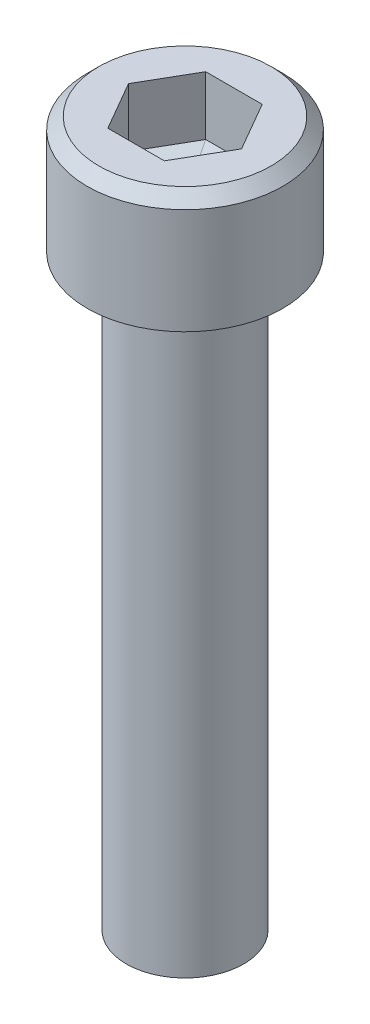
ISO-10303-21;
HEADER;
FILE_DESCRIPTION(('STEP AP214'),'2;1');
FILE_NAME('part.step','',(''),(''),'','','');
FILE_SCHEMA(('AUTOMOTIVE_DESIGN { 1 0 10303 214 1 1 1 1 }'));
ENDSEC;
DATA;
#1=APPLICATION_CONTEXT('core data for automotive mechanical design processes');
#2=APPLICATION_PROTOCOL_DEFINITION('international standard','automotive_design',2000,#1);
#3=PRODUCT_CONTEXT('',#1,'mechanical');
#4=PRODUCT('Part','Part','',(#3));
#5=PRODUCT_RELATED_PRODUCT_CATEGORY('part','',(#4));
#6=PRODUCT_DEFINITION_FORMATION('','',#4);
#7=PRODUCT_DEFINITION_CONTEXT('part definition',#1,'design');
#8=PRODUCT_DEFINITION('design','',#6,#7);
#9=PRODUCT_DEFINITION_SHAPE('','',#8);
#10=(LENGTH_UNIT() NAMED_UNIT(*) SI_UNIT(.MILLI.,.METRE.));
#11=(NAMED_UNIT(*) PLANE_ANGLE_UNIT() SI_UNIT($,.RADIAN.));
#12=(NAMED_UNIT(*) SI_UNIT($,.STERADIAN.) SOLID_ANGLE_UNIT());
#13=UNCERTAINTY_MEASURE_WITH_UNIT(LENGTH_MEASURE(1.E-05),#10,'distance_accuracy_value','');
#14=(GEOMETRIC_REPRESENTATION_CONTEXT(3) GLOBAL_UNCERTAINTY_ASSIGNED_CONTEXT((#13)) GLOBAL_UNIT_ASSIGNED_CONTEXT((#10,
#11,#12)) REPRESENTATION_CONTEXT('',''));
#15=CARTESIAN_POINT('',(0.,0.,0.));
#16=DIRECTION('',(0.,0.,1.));
#17=DIRECTION('',(1.,0.,0.));
#18=AXIS2_PLACEMENT_3D('',#15,#16,#17);
#19=CARTESIAN_POINT('',(-1.082531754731,-3.29999999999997,0.625000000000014));
#20=DIRECTION('',(-0.202106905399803,-0.972387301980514,0.116686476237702));
#21=DIRECTION('',(0.979075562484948,-0.203497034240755,0.));
#22=AXIS2_PLACEMENT_3D('',#19,#20,#21);
#23=PLANE('',#22);
#24=DIRECTION('',(0.500000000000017,0.,0.866025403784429));
#25=VECTOR('',#24,1.);
#26=CARTESIAN_POINT('',(-2.886751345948,-3.00000000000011,0.));
#27=LINE('',#26,#25);
#28=CARTESIAN_POINT('',(-2.88675134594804,-3.0000000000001,0.));
#29=VERTEX_POINT('',#28);
#30=CARTESIAN_POINT('',(-1.44337567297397,-3.00000000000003,2.49999999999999));
#31=VERTEX_POINT('',#30);
#32=EDGE_CURVE('E106',#29,#31,#27,.T.);
#33=ORIENTED_EDGE('',*,*,#32,.T.);
#34=DIRECTION('',(0.489537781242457,-0.203497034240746,-0.847904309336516));
#35=VECTOR('',#34,1.);
#36=CARTESIAN_POINT('',(-1.44337567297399,-2.99999999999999,2.5));
#37=LINE('',#36,#35);
#38=CARTESIAN_POINT('',(0.,-3.60000000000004,0.));
#39=VERTEX_POINT('',#38);
#40=EDGE_CURVE('E105',#31,#39,#37,.T.);
#41=ORIENTED_EDGE('',*,*,#40,.T.);
#42=DIRECTION('',(0.979075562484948,-0.203497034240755,0.));
#43=VECTOR('',#42,1.);
#44=CARTESIAN_POINT('',(-1.09747467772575,-3.37189417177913,0.));
#45=LINE('',#44,#43);
#46=EDGE_CURVE('E70',#39,#29,#45,.F.);
#47=ORIENTED_EDGE('',*,*,#46,.T.);
#48=EDGE_LOOP('',(#33,#41,#47));
#49=FACE_BOUND('',#48,.T.);
#50=ADVANCED_FACE('F16',(#49),#23,.F.);
#51=CARTESIAN_POINT('',(-1.082531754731,-3.29999999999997,-0.624999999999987));
#52=DIRECTION('',(-0.202106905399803,-0.972387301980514,-0.116686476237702));
#53=DIRECTION('',(0.979075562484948,-0.203497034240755,0.));
#54=AXIS2_PLACEMENT_3D('',#51,#52,#53);
#55=PLANE('',#54);
#56=DIRECTION('',(-0.500000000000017,0.,0.866025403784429));
#57=VECTOR('',#56,1.);
#58=CARTESIAN_POINT('',(-1.443375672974,-3.,-2.5));
#59=LINE('',#58,#57);
#60=CARTESIAN_POINT('',(-1.443375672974,-3.,-2.5));
#61=VERTEX_POINT('',#60);
#62=EDGE_CURVE('E78',#61,#29,#59,.T.);
#63=ORIENTED_EDGE('',*,*,#62,.T.);
#64=ORIENTED_EDGE('',*,*,#46,.F.);
#65=DIRECTION('',(-0.489537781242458,0.203497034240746,-0.847904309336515));
#66=VECTOR('',#65,1.);
#67=CARTESIAN_POINT('',(0.,-3.59999999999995,0.));
#68=LINE('',#67,#66);
#69=EDGE_CURVE('E75',#39,#61,#68,.T.);
#70=ORIENTED_EDGE('',*,*,#69,.T.);
#71=EDGE_LOOP('',(#63,#64,#70));
#72=FACE_BOUND('',#71,.T.);
#73=ADVANCED_FACE('F74',(#72),#55,.F.);
#74=CARTESIAN_POINT('',(0.,-3.29999999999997,-1.25));
#75=DIRECTION('',(0.,-0.972387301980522,-0.233372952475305));
#76=DIRECTION('',(0.,0.233372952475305,-0.972387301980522));
#77=AXIS2_PLACEMENT_3D('',#74,#75,#76);
#78=PLANE('',#77);
#79=DIRECTION('',(1.,0.,0.));
#80=VECTOR('',#79,1.);
#81=CARTESIAN_POINT('',(1.443375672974,-3.,-2.5));
#82=LINE('',#81,#80);
#83=CARTESIAN_POINT('',(1.44337567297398,-3.00000000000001,-2.49999999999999));
#84=VERTEX_POINT('',#83);
#85=EDGE_CURVE('E87',#84,#61,#82,.F.);
#86=ORIENTED_EDGE('',*,*,#85,.T.);
#87=ORIENTED_EDGE('',*,*,#69,.F.);
#88=DIRECTION('',(0.489537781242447,0.203497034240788,-0.847904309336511));
#89=VECTOR('',#88,1.);
#90=CARTESIAN_POINT('',(0.,-3.60000000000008,0.));
#91=LINE('',#90,#89);
#92=EDGE_CURVE('E84',#39,#84,#91,.T.);
#93=ORIENTED_EDGE('',*,*,#92,.T.);
#94=EDGE_LOOP('',(#86,#87,#93));
#95=FACE_BOUND('',#94,.T.);
#96=ADVANCED_FACE('F83',(#95),#78,.F.);
#97=CARTESIAN_POINT('',(1.082531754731,-3.29999999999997,-0.624999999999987));
#98=DIRECTION('',(0.202106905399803,-0.972387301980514,-0.116686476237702));
#99=DIRECTION('',(0.979075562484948,0.203497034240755,0.));
#100=AXIS2_PLACEMENT_3D('',#97,#98,#99);
#101=PLANE('',#100);
#102=DIRECTION('',(-0.500000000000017,0.,-0.866025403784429));
#103=VECTOR('',#102,1.);
#104=CARTESIAN_POINT('',(2.886751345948,-3.00000000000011,0.));
#105=LINE('',#104,#103);
#106=CARTESIAN_POINT('',(2.88675134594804,-3.0000000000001,0.));
#107=VERTEX_POINT('',#106);
#108=EDGE_CURVE('E95',#107,#84,#105,.T.);
#109=ORIENTED_EDGE('',*,*,#108,.T.);
#110=ORIENTED_EDGE('',*,*,#92,.F.);
#111=DIRECTION('',(0.979075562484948,0.203497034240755,0.));
#112=VECTOR('',#111,1.);
#113=CARTESIAN_POINT('',(1.09747467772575,-3.37189417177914,0.));
#114=LINE('',#113,#112);
#115=EDGE_CURVE('E92',#39,#107,#114,.T.);
#116=ORIENTED_EDGE('',*,*,#115,.T.);
#117=EDGE_LOOP('',(#109,#110,#116));
#118=FACE_BOUND('',#117,.T.);
#119=ADVANCED_FACE('F91',(#118),#101,.F.);
#120=CARTESIAN_POINT('',(1.082531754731,-3.29999999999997,0.625000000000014));
#121=DIRECTION('',(0.202106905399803,-0.972387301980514,0.116686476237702));
#122=DIRECTION('',(0.979075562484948,0.203497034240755,0.));
#123=AXIS2_PLACEMENT_3D('',#120,#121,#122);
#124=PLANE('',#123);
#125=DIRECTION('',(0.500000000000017,0.,-0.866025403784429));
#126=VECTOR('',#125,1.);
#127=CARTESIAN_POINT('',(1.443375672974,-3.,2.5));
#128=LINE('',#127,#126);
#129=CARTESIAN_POINT('',(1.443375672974,-3.,2.5));
#130=VERTEX_POINT('',#129);
#131=EDGE_CURVE('E102',#130,#107,#128,.T.);
#132=ORIENTED_EDGE('',*,*,#131,.T.);
#133=ORIENTED_EDGE('',*,*,#115,.F.);
#134=DIRECTION('',(0.489537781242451,0.203497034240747,0.847904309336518));
#135=VECTOR('',#134,1.);
#136=CARTESIAN_POINT('',(0.,-3.59999999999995,0.));
#137=LINE('',#136,#135);
#138=EDGE_CURVE('E100',#39,#130,#137,.T.);
#139=ORIENTED_EDGE('',*,*,#138,.T.);
#140=EDGE_LOOP('',(#132,#133,#139));
#141=FACE_BOUND('',#140,.T.);
#142=ADVANCED_FACE('F98',(#141),#124,.F.);
#143=CARTESIAN_POINT('',(0.,-3.29999999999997,1.25));
#144=DIRECTION('',(0.,-0.972387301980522,0.233372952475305));
#145=DIRECTION('',(0.,-0.233372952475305,-0.972387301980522));
#146=AXIS2_PLACEMENT_3D('',#143,#144,#145);
#147=PLANE('',#146);
#148=DIRECTION('',(1.,0.,0.));
#149=VECTOR('',#148,1.);
#150=CARTESIAN_POINT('',(-1.443375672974,-3.,2.5));
#151=LINE('',#150,#149);
#152=EDGE_CURVE('E112',#31,#130,#151,.T.);
#153=ORIENTED_EDGE('',*,*,#152,.T.);
#154=ORIENTED_EDGE('',*,*,#138,.F.);
#155=ORIENTED_EDGE('',*,*,#40,.F.);
#156=EDGE_LOOP('',(#153,#154,#155));
#157=FACE_BOUND('',#156,.T.);
#158=ADVANCED_FACE('F111',(#157),#147,.F.);
#159=CARTESIAN_POINT('',(-2.886751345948,0.,0.));
#160=DIRECTION('',(-0.866025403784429,0.,0.500000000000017));
#161=DIRECTION('',(0.500000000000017,0.,0.866025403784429));
#162=AXIS2_PLACEMENT_3D('',#159,#160,#161);
#163=PLANE('',#162);
#164=DIRECTION('',(0.,-1.,0.));
#165=VECTOR('',#164,1.);
#166=CARTESIAN_POINT('',(-1.44337567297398,0.,2.5));
#167=LINE('',#166,#165);
#168=CARTESIAN_POINT('',(-1.44337567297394,0.,2.49999999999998));
#169=VERTEX_POINT('',#168);
#170=EDGE_CURVE('E148',#169,#31,#167,.T.);
#171=ORIENTED_EDGE('',*,*,#170,.T.);
#172=ORIENTED_EDGE('',*,*,#32,.F.);
#173=DIRECTION('',(0.,1.,0.));
#174=VECTOR('',#173,1.);
#175=CARTESIAN_POINT('',(-2.88675134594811,0.,0.));
#176=LINE('',#175,#174);
#177=CARTESIAN_POINT('',(-2.88675134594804,0.,0.));
#178=VERTEX_POINT('',#177);
#179=EDGE_CURVE('E159',#29,#178,#176,.T.);
#180=ORIENTED_EDGE('',*,*,#179,.T.);
#181=DIRECTION('',(-0.499999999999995,0.,-0.866025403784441));
#182=VECTOR('',#181,1.);
#183=CARTESIAN_POINT('',(-1.44337567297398,0.,2.49999999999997));
#184=LINE('',#183,#182);
#185=EDGE_CURVE('E143',#169,#178,#184,.T.);
#186=ORIENTED_EDGE('',*,*,#185,.F.);
#187=EDGE_LOOP('',(#171,#172,#180,#186));
#188=FACE_BOUND('',#187,.T.);
#189=ADVANCED_FACE('F164',(#188),#163,.F.);
#190=CARTESIAN_POINT('',(-1.443375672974,0.,-2.5));
#191=DIRECTION('',(-0.866025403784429,0.,-0.500000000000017));
#192=DIRECTION('',(-0.500000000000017,0.,0.866025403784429));
#193=AXIS2_PLACEMENT_3D('',#190,#191,#192);
#194=PLANE('',#193);
#195=ORIENTED_EDGE('',*,*,#179,.F.);
#196=ORIENTED_EDGE('',*,*,#62,.F.);
#197=DIRECTION('',(0.,1.,0.));
#198=VECTOR('',#197,1.);
#199=CARTESIAN_POINT('',(-1.443375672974,0.,-2.5));
#200=LINE('',#199,#198);
#201=CARTESIAN_POINT('',(-1.443375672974,0.,-2.5));
#202=VERTEX_POINT('',#201);
#203=EDGE_CURVE('E156',#61,#202,#200,.T.);
#204=ORIENTED_EDGE('',*,*,#203,.T.);
#205=DIRECTION('',(0.499999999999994,0.,-0.866025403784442));
#206=VECTOR('',#205,1.);
#207=CARTESIAN_POINT('',(-2.88675134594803,0.,0.));
#208=LINE('',#207,#206);
#209=EDGE_CURVE('E140',#178,#202,#208,.T.);
#210=ORIENTED_EDGE('',*,*,#209,.F.);
#211=EDGE_LOOP('',(#195,#196,#204,#210));
#212=FACE_BOUND('',#211,.T.);
#213=ADVANCED_FACE('F167',(#212),#194,.F.);
#214=CARTESIAN_POINT('',(1.443375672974,0.,-2.5));
#215=DIRECTION('',(0.,0.,-1.));
#216=DIRECTION('',(0.,1.,0.));
#217=AXIS2_PLACEMENT_3D('',#214,#215,#216);
#218=PLANE('',#217);
#219=ORIENTED_EDGE('',*,*,#203,.F.);
#220=ORIENTED_EDGE('',*,*,#85,.F.);
#221=DIRECTION('',(0.,1.,0.));
#222=VECTOR('',#221,1.);
#223=CARTESIAN_POINT('',(1.4433756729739,0.,-2.49999999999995));
#224=LINE('',#223,#222);
#225=CARTESIAN_POINT('',(1.44337567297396,0.,-2.49999999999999));
#226=VERTEX_POINT('',#225);
#227=EDGE_CURVE('E153',#84,#226,#224,.T.);
#228=ORIENTED_EDGE('',*,*,#227,.T.);
#229=DIRECTION('',(1.,0.,0.));
#230=VECTOR('',#229,1.);
#231=CARTESIAN_POINT('',(0.,0.,-2.5));
#232=LINE('',#231,#230);
#233=EDGE_CURVE('E137',#202,#226,#232,.T.);
#234=ORIENTED_EDGE('',*,*,#233,.F.);
#235=EDGE_LOOP('',(#219,#220,#228,#234));
#236=FACE_BOUND('',#235,.T.);
#237=ADVANCED_FACE('F266',(#236),#218,.F.);
#238=CARTESIAN_POINT('',(2.886751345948,0.,0.));
#239=DIRECTION('',(0.866025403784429,0.,-0.500000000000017));
#240=DIRECTION('',(-0.500000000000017,0.,-0.866025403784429));
#241=AXIS2_PLACEMENT_3D('',#238,#239,#240);
#242=PLANE('',#241);
#243=ORIENTED_EDGE('',*,*,#227,.F.);
#244=ORIENTED_EDGE('',*,*,#108,.F.);
#245=DIRECTION('',(0.,1.,0.));
#246=VECTOR('',#245,1.);
#247=CARTESIAN_POINT('',(2.88675134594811,0.,0.));
#248=LINE('',#247,#246);
#249=CARTESIAN_POINT('',(2.88675134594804,0.,0.));
#250=VERTEX_POINT('',#249);
#251=EDGE_CURVE('E150',#107,#250,#248,.T.);
#252=ORIENTED_EDGE('',*,*,#251,.T.);
#253=DIRECTION('',(0.499999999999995,0.,0.866025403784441));
#254=VECTOR('',#253,1.);
#255=CARTESIAN_POINT('',(1.44337567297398,0.,-2.49999999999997));
#256=LINE('',#255,#254);
#257=EDGE_CURVE('E134',#226,#250,#256,.T.);
#258=ORIENTED_EDGE('',*,*,#257,.F.);
#259=EDGE_LOOP('',(#243,#244,#252,#258));
#260=FACE_BOUND('',#259,.T.);
#261=ADVANCED_FACE('F185',(#260),#242,.F.);
#262=CARTESIAN_POINT('',(1.443375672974,0.,2.5));
#263=DIRECTION('',(0.866025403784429,0.,0.500000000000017));
#264=DIRECTION('',(0.500000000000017,0.,-0.866025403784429));
#265=AXIS2_PLACEMENT_3D('',#262,#263,#264);
#266=PLANE('',#265);
#267=ORIENTED_EDGE('',*,*,#251,.F.);
#268=ORIENTED_EDGE('',*,*,#131,.F.);
#269=DIRECTION('',(0.,-1.,0.));
#270=VECTOR('',#269,1.);
#271=CARTESIAN_POINT('',(1.443375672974,0.,2.5));
#272=LINE('',#271,#270);
#273=CARTESIAN_POINT('',(1.443375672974,0.,2.5));
#274=VERTEX_POINT('',#273);
#275=EDGE_CURVE('E34',#130,#274,#272,.F.);
#276=ORIENTED_EDGE('',*,*,#275,.T.);
#277=DIRECTION('',(-0.499999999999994,0.,0.866025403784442));
#278=VECTOR('',#277,1.);
#279=CARTESIAN_POINT('',(2.88675134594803,0.,0.));
#280=LINE('',#279,#278);
#281=EDGE_CURVE('E131',#250,#274,#280,.T.);
#282=ORIENTED_EDGE('',*,*,#281,.F.);
#283=EDGE_LOOP('',(#267,#268,#276,#282));
#284=FACE_BOUND('',#283,.T.);
#285=ADVANCED_FACE('F175',(#284),#266,.F.);
#286=CARTESIAN_POINT('',(-1.443375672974,0.,2.5));
#287=DIRECTION('',(0.,0.,1.));
#288=DIRECTION('',(0.,-1.,0.));
#289=AXIS2_PLACEMENT_3D('',#286,#287,#288);
#290=PLANE('',#289);
#291=ORIENTED_EDGE('',*,*,#275,.F.);
#292=ORIENTED_EDGE('',*,*,#152,.F.);
#293=ORIENTED_EDGE('',*,*,#170,.F.);
#294=DIRECTION('',(1.,0.,0.));
#295=VECTOR('',#294,1.);
#296=CARTESIAN_POINT('',(0.,0.,2.5));
#297=LINE('',#296,#295);
#298=EDGE_CURVE('E127',#274,#169,#297,.F.);
#299=ORIENTED_EDGE('',*,*,#298,.F.);
#300=EDGE_LOOP('',(#291,#292,#293,#299));
#301=FACE_BOUND('',#300,.T.);
#302=ADVANCED_FACE('F173',(#301),#290,.F.);
#303=CARTESIAN_POINT('',(0.,0.,0.));
#304=DIRECTION('',(0.,1.,0.));
#305=DIRECTION('',(0.,0.,1.));
#306=AXIS2_PLACEMENT_3D('',#303,#304,#305);
#307=PLANE('',#306);
#308=CARTESIAN_POINT('',(0.,0.,0.));
#309=DIRECTION('',(0.,-1.,0.));
#310=DIRECTION('',(0.,0.,-1.));
#311=AXIS2_PLACEMENT_3D('',#308,#309,#310);
#312=CIRCLE('',#311,4.39999999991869);
#313=CARTESIAN_POINT('',(0.,0.,-4.39999999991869));
#314=VERTEX_POINT('',#313);
#315=EDGE_CURVE('E19',#314,#314,#312,.T.);
#316=ORIENTED_EDGE('',*,*,#315,.F.);
#317=EDGE_LOOP('',(#316));
#318=FACE_BOUND('',#317,.T.);
#319=ORIENTED_EDGE('',*,*,#281,.T.);
#320=ORIENTED_EDGE('',*,*,#298,.T.);
#321=ORIENTED_EDGE('',*,*,#185,.T.);
#322=ORIENTED_EDGE('',*,*,#209,.T.);
#323=ORIENTED_EDGE('',*,*,#233,.T.);
#324=ORIENTED_EDGE('',*,*,#257,.T.);
#325=EDGE_LOOP('',(#319,#320,#321,#322,#323,#324));
#326=FACE_BOUND('',#325,.T.);
#327=ADVANCED_FACE('F171',(#318,#326),#307,.T.);
#328=CARTESIAN_POINT('',(0.,-0.600000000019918,0.));
#329=DIRECTION('',(0.,-1.,0.));
#330=DIRECTION('',(0.,0.,-1.));
#331=AXIS2_PLACEMENT_3D('',#328,#329,#330);
#332=CONICAL_SURFACE('',#331,4.99999999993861,0.785398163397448);
#333=CARTESIAN_POINT('',(0.,-0.600000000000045,0.));
#334=DIRECTION('',(0.,1.,0.));
#335=DIRECTION('',(0.,0.,1.));
#336=AXIS2_PLACEMENT_3D('',#333,#334,#335);
#337=CIRCLE('',#336,5.);
#338=CARTESIAN_POINT('',(0.,-0.600000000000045,5.));
#339=VERTEX_POINT('',#338);
#340=EDGE_CURVE('E119',#339,#339,#337,.F.);
#341=ORIENTED_EDGE('',*,*,#340,.F.);
#342=EDGE_LOOP('',(#341));
#343=FACE_BOUND('',#342,.T.);
#344=ORIENTED_EDGE('',*,*,#315,.T.);
#345=EDGE_LOOP('',(#344));
#346=FACE_BOUND('',#345,.T.);
#347=ADVANCED_FACE('F182',(#343,#346),#332,.T.);
#348=CARTESIAN_POINT('',(0.,-37.8000000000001,0.));
#349=DIRECTION('',(0.,1.,0.));
#350=DIRECTION('',(0.,0.,1.));
#351=AXIS2_PLACEMENT_3D('',#348,#349,#350);
#352=CYLINDRICAL_SURFACE('',#351,5.);
#353=ORIENTED_EDGE('',*,*,#340,.T.);
#354=EDGE_LOOP('',(#353));
#355=FACE_BOUND('',#354,.T.);
#356=CARTESIAN_POINT('',(0.,-6.00000000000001,0.));
#357=DIRECTION('',(0.,1.,0.));
#358=DIRECTION('',(0.,0.,1.));
#359=AXIS2_PLACEMENT_3D('',#356,#357,#358);
#360=CIRCLE('',#359,5.);
#361=CARTESIAN_POINT('',(0.,-6.00000000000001,5.));
#362=VERTEX_POINT('',#361);
#363=EDGE_CURVE('E117',#362,#362,#360,.T.);
#364=ORIENTED_EDGE('',*,*,#363,.T.);
#365=EDGE_LOOP('',(#364));
#366=FACE_BOUND('',#365,.T.);
#367=ADVANCED_FACE('F202',(#355,#366),#352,.T.);
#368=CARTESIAN_POINT('',(0.,-36.,0.));
#369=DIRECTION('',(0.,1.,0.));
#370=DIRECTION('',(0.,0.,1.));
#371=AXIS2_PLACEMENT_3D('',#368,#369,#370);
#372=PLANE('',#371);
#373=CARTESIAN_POINT('',(0.,-36.,0.));
#374=DIRECTION('',(0.,1.,0.));
#375=DIRECTION('',(0.,0.,1.));
#376=AXIS2_PLACEMENT_3D('',#373,#374,#375);
#377=CIRCLE('',#376,3.);
#378=CARTESIAN_POINT('',(0.,-36.,3.));
#379=VERTEX_POINT('',#378);
#380=EDGE_CURVE('E25',#379,#379,#377,.T.);
#381=ORIENTED_EDGE('',*,*,#380,.F.);
#382=EDGE_LOOP('',(#381));
#383=FACE_BOUND('',#382,.T.);
#384=ADVANCED_FACE('F195',(#383),#372,.F.);
#385=CARTESIAN_POINT('',(0.,-6.00000000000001,0.));
#386=DIRECTION('',(0.,1.,0.));
#387=DIRECTION('',(0.,0.,1.));
#388=AXIS2_PLACEMENT_3D('',#385,#386,#387);
#389=PLANE('',#388);
#390=ORIENTED_EDGE('',*,*,#363,.F.);
#391=EDGE_LOOP('',(#390));
#392=FACE_BOUND('',#391,.T.);
#393=CARTESIAN_POINT('',(0.,-6.00000000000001,0.));
#394=DIRECTION('',(0.,1.,0.));
#395=DIRECTION('',(0.,0.,1.));
#396=AXIS2_PLACEMENT_3D('',#393,#394,#395);
#397=CIRCLE('',#396,3.);
#398=CARTESIAN_POINT('',(0.,-6.00000000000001,3.));
#399=VERTEX_POINT('',#398);
#400=EDGE_CURVE('E11',#399,#399,#397,.F.);
#401=ORIENTED_EDGE('',*,*,#400,.F.);
#402=EDGE_LOOP('',(#401));
#403=FACE_BOUND('',#402,.T.);
#404=ADVANCED_FACE('F189',(#392,#403),#389,.F.);
#405=CARTESIAN_POINT('',(0.,-37.8000000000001,0.));
#406=DIRECTION('',(0.,1.,0.));
#407=DIRECTION('',(0.,0.,1.));
#408=AXIS2_PLACEMENT_3D('',#405,#406,#407);
#409=CYLINDRICAL_SURFACE('',#408,3.);
#410=ORIENTED_EDGE('',*,*,#400,.T.);
#411=EDGE_LOOP('',(#410));
#412=FACE_BOUND('',#411,.T.);
#413=ORIENTED_EDGE('',*,*,#380,.T.);
#414=EDGE_LOOP('',(#413));
#415=FACE_BOUND('',#414,.T.);
#416=ADVANCED_FACE('F187',(#412,#415),#409,.T.);
#417=CLOSED_SHELL('',(#50,#73,#96,#119,#142,#158,#189,#213,#237,#261,#285,#302,#327,#347,#367,
#384,#404,#416));
#418=MANIFOLD_SOLID_BREP('B1',#417);
#419=ADVANCED_BREP_SHAPE_REPRESENTATION('',(#18,#418),#14);
#420=SHAPE_DEFINITION_REPRESENTATION(#9,#419);
ENDSEC;
END-ISO-10303-21;
